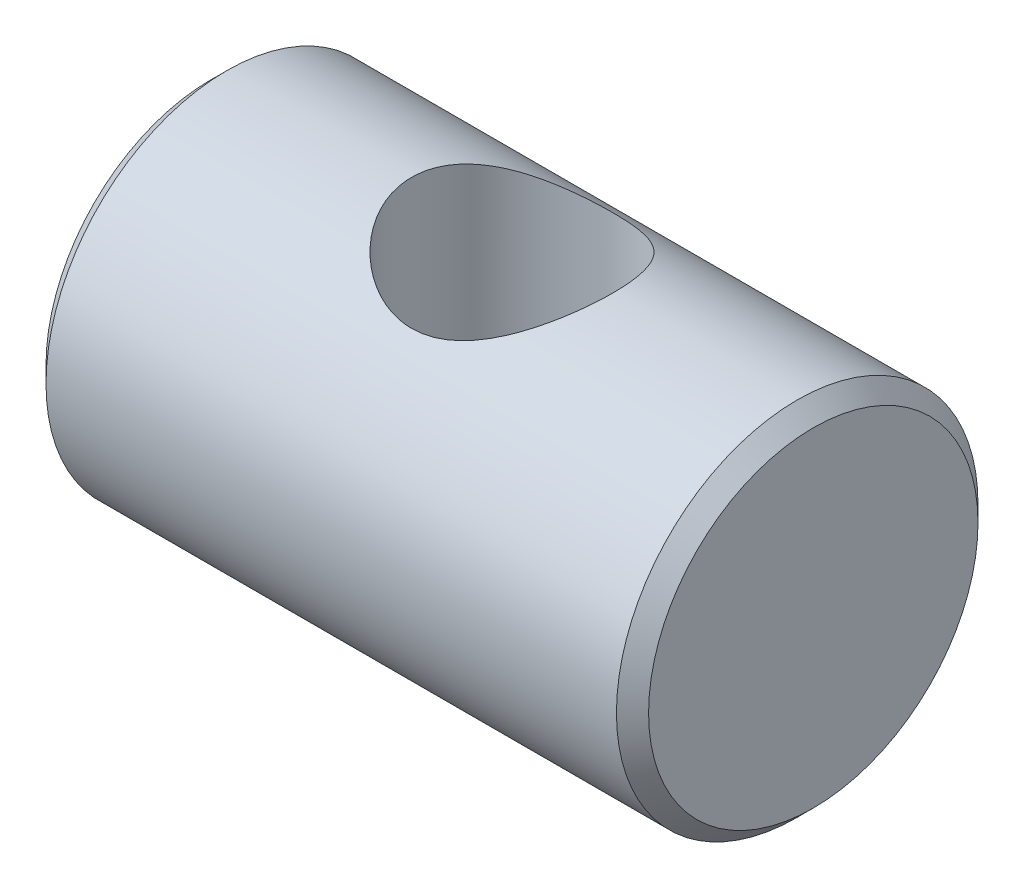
ISO-10303-21;
HEADER;
FILE_DESCRIPTION(('STEP AP214'),'2;1');
FILE_NAME('part.step','',(''),(''),'','','');
FILE_SCHEMA(('AUTOMOTIVE_DESIGN { 1 0 10303 214 1 1 1 1 }'));
ENDSEC;
DATA;
#1=APPLICATION_CONTEXT('core data for automotive mechanical design processes');
#2=APPLICATION_PROTOCOL_DEFINITION('international standard','automotive_design',2000,#1);
#3=PRODUCT_CONTEXT('',#1,'mechanical');
#4=PRODUCT('Part','Part','',(#3));
#5=PRODUCT_RELATED_PRODUCT_CATEGORY('part','',(#4));
#6=PRODUCT_DEFINITION_FORMATION('','',#4);
#7=PRODUCT_DEFINITION_CONTEXT('part definition',#1,'design');
#8=PRODUCT_DEFINITION('design','',#6,#7);
#9=PRODUCT_DEFINITION_SHAPE('','',#8);
#10=(LENGTH_UNIT() NAMED_UNIT(*) SI_UNIT(.MILLI.,.METRE.));
#11=(NAMED_UNIT(*) PLANE_ANGLE_UNIT() SI_UNIT($,.RADIAN.));
#12=(NAMED_UNIT(*) SI_UNIT($,.STERADIAN.) SOLID_ANGLE_UNIT());
#13=UNCERTAINTY_MEASURE_WITH_UNIT(LENGTH_MEASURE(1.E-05),#10,'distance_accuracy_value','');
#14=(GEOMETRIC_REPRESENTATION_CONTEXT(3) GLOBAL_UNCERTAINTY_ASSIGNED_CONTEXT((#13)) GLOBAL_UNIT_ASSIGNED_CONTEXT((#10,
#11,#12)) REPRESENTATION_CONTEXT('',''));
#15=CARTESIAN_POINT('',(0.,0.,0.));
#16=DIRECTION('',(0.,0.,1.));
#17=DIRECTION('',(1.,0.,0.));
#18=AXIS2_PLACEMENT_3D('',#15,#16,#17);
#19=CARTESIAN_POINT('',(7.5,4.1,0.));
#20=DIRECTION('',(-1.,0.,0.));
#21=DIRECTION('',(0.,0.,1.));
#22=AXIS2_PLACEMENT_3D('',#19,#20,#21);
#23=PLANE('',#22);
#24=CARTESIAN_POINT('',(7.49999999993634,0.,0.));
#25=DIRECTION('',(-1.,0.,0.));
#26=DIRECTION('',(0.,0.,1.));
#27=AXIS2_PLACEMENT_3D('',#24,#25,#26);
#28=CIRCLE('',#27,4.099999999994);
#29=CARTESIAN_POINT('',(7.49999999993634,0.,4.099999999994));
#30=VERTEX_POINT('',#29);
#31=EDGE_CURVE('E64',#30,#30,#28,.T.);
#32=ORIENTED_EDGE('',*,*,#31,.F.);
#33=EDGE_LOOP('',(#32));
#34=FACE_BOUND('',#33,.T.);
#35=ADVANCED_FACE('F12',(#34),#23,.F.);
#36=CARTESIAN_POINT('',(-7.5,0.,0.));
#37=DIRECTION('',(1.,0.,0.));
#38=DIRECTION('',(0.,0.,-1.));
#39=AXIS2_PLACEMENT_3D('',#36,#37,#38);
#40=PLANE('',#39);
#41=CARTESIAN_POINT('',(-7.49999999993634,0.,0.));
#42=DIRECTION('',(1.,0.,0.));
#43=DIRECTION('',(0.,0.,-1.));
#44=AXIS2_PLACEMENT_3D('',#41,#42,#43);
#45=CIRCLE('',#44,4.099999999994);
#46=CARTESIAN_POINT('',(-7.49999999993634,0.,-4.099999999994));
#47=VERTEX_POINT('',#46);
#48=EDGE_CURVE('E66',#47,#47,#45,.T.);
#49=ORIENTED_EDGE('',*,*,#48,.F.);
#50=EDGE_LOOP('',(#49));
#51=FACE_BOUND('',#50,.T.);
#52=ADVANCED_FACE('F54',(#51),#40,.F.);
#53=CARTESIAN_POINT('',(7.0999999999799,0.,0.));
#54=DIRECTION('',(-1.,0.,0.));
#55=DIRECTION('',(0.,0.,1.));
#56=AXIS2_PLACEMENT_3D('',#53,#54,#55);
#57=CONICAL_SURFACE('',#56,4.50000000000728,0.785398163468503);
#58=CARTESIAN_POINT('',(7.1,0.,0.));
#59=DIRECTION('',(1.,0.,0.));
#60=DIRECTION('',(0.,0.,-1.));
#61=AXIS2_PLACEMENT_3D('',#58,#59,#60);
#62=CIRCLE('',#61,4.5);
#63=CARTESIAN_POINT('',(7.1,0.,-4.5));
#64=VERTEX_POINT('',#63);
#65=EDGE_CURVE('E31',#64,#64,#62,.F.);
#66=ORIENTED_EDGE('',*,*,#65,.F.);
#67=EDGE_LOOP('',(#66));
#68=FACE_BOUND('',#67,.T.);
#69=ORIENTED_EDGE('',*,*,#31,.T.);
#70=EDGE_LOOP('',(#69));
#71=FACE_BOUND('',#70,.T.);
#72=ADVANCED_FACE('F60',(#68,#71),#57,.T.);
#73=CARTESIAN_POINT('',(-7.09999999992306,0.,0.));
#74=DIRECTION('',(1.,0.,0.));
#75=DIRECTION('',(0.,0.,-1.));
#76=AXIS2_PLACEMENT_3D('',#73,#74,#75);
#77=CONICAL_SURFACE('',#76,4.50000000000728,0.785398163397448);
#78=ORIENTED_EDGE('',*,*,#48,.T.);
#79=EDGE_LOOP('',(#78));
#80=FACE_BOUND('',#79,.T.);
#81=CARTESIAN_POINT('',(-7.1,0.,0.));
#82=DIRECTION('',(1.,0.,0.));
#83=DIRECTION('',(0.,0.,-1.));
#84=AXIS2_PLACEMENT_3D('',#81,#82,#83);
#85=CIRCLE('',#84,4.5);
#86=CARTESIAN_POINT('',(-7.1,0.,-4.5));
#87=VERTEX_POINT('',#86);
#88=EDGE_CURVE('E27',#87,#87,#85,.T.);
#89=ORIENTED_EDGE('',*,*,#88,.F.);
#90=EDGE_LOOP('',(#89));
#91=FACE_BOUND('',#90,.T.);
#92=ADVANCED_FACE('F51',(#80,#91),#77,.T.);
#93=CARTESIAN_POINT('',(7.5,0.,0.));
#94=DIRECTION('',(1.,0.,0.));
#95=DIRECTION('',(0.,0.,-1.));
#96=AXIS2_PLACEMENT_3D('',#93,#94,#95);
#97=CYLINDRICAL_SURFACE('',#96,4.5);
#98=CARTESIAN_POINT('',(2.5,-4.5,0.));
#99=CARTESIAN_POINT('',(2.5000036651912,-4.50000314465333,0.12975809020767));
#100=CARTESIAN_POINT('',(2.48985342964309,-4.49433969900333,0.259495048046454));
#101=CARTESIAN_POINT('',(2.44980813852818,-4.4722793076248,0.514936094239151));
#102=CARTESIAN_POINT('',(2.41990941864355,-4.45588036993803,0.640639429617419));
#103=CARTESIAN_POINT('',(2.34193984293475,-4.41402427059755,0.884087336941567));
#104=CARTESIAN_POINT('',(2.29393574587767,-4.3886004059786,1.0018592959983));
#105=CARTESIAN_POINT('',(2.18156833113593,-4.33092577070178,1.2274597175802));
#106=CARTESIAN_POINT('',(2.11720108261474,-4.29867335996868,1.33528578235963));
#107=CARTESIAN_POINT('',(1.96891331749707,-4.22753981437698,1.54633615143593));
#108=CARTESIAN_POINT('',(1.88394435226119,-4.18835368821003,1.64871905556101));
#109=CARTESIAN_POINT('',(1.69916733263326,-4.10855473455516,1.83858802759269));
#110=CARTESIAN_POINT('',(1.59934431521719,-4.06794050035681,1.92605888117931));
#111=CARTESIAN_POINT('',(1.37568478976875,-3.98505246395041,2.09257063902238));
#112=CARTESIAN_POINT('',(1.25043989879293,-3.94302761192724,2.1698588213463));
#113=CARTESIAN_POINT('',(0.986308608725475,-3.86741690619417,2.30193682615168));
#114=CARTESIAN_POINT('',(0.847442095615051,-3.83381899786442,2.35675885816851));
#115=CARTESIAN_POINT('',(0.589942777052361,-3.78623301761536,2.43228219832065));
#116=CARTESIAN_POINT('',(0.473190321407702,-3.76960776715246,2.4577327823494));
#117=CARTESIAN_POINT('',(0.236264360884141,-3.74726165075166,2.49167870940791));
#118=CARTESIAN_POINT('',(0.116094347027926,-3.74153003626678,2.50019076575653));
#119=CARTESIAN_POINT('',(-0.12433109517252,-3.74178926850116,2.49980245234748));
#120=CARTESIAN_POINT('',(-0.244586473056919,-3.74779295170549,2.49088301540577));
#121=CARTESIAN_POINT('',(-0.481577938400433,-3.77067196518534,2.45610447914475));
#122=CARTESIAN_POINT('',(-0.598311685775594,-3.78755436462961,2.43023436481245));
#123=CARTESIAN_POINT('',(-0.825432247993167,-3.82999424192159,2.36277650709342));
#124=CARTESIAN_POINT('',(-0.93581764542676,-3.85555364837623,2.32118526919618));
#125=CARTESIAN_POINT('',(-1.14840752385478,-3.91258606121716,2.22370256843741));
#126=CARTESIAN_POINT('',(-1.25060878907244,-3.9440613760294,2.16780552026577));
#127=CARTESIAN_POINT('',(-1.46041329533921,-4.01517496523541,2.03346434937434));
#128=CARTESIAN_POINT('',(-1.56647725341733,-4.05532685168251,1.95288470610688));
#129=CARTESIAN_POINT('',(-1.76453695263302,-4.13586693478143,1.77596825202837));
#130=CARTESIAN_POINT('',(-1.85652147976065,-4.17625529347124,1.67961900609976));
#131=CARTESIAN_POINT('',(-2.0331489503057,-4.25757409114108,1.4621390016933));
#132=CARTESIAN_POINT('',(-2.11610219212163,-4.29814437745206,1.33948616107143));
#133=CARTESIAN_POINT('',(-2.25981054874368,-4.37068555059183,1.07947802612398));
#134=CARTESIAN_POINT('',(-2.32058027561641,-4.40266209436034,0.942132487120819));
#135=CARTESIAN_POINT('',(-2.41351083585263,-4.45237093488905,0.666748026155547));
#136=CARTESIAN_POINT('',(-2.44739476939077,-4.4709525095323,0.529448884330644));
#137=CARTESIAN_POINT('',(-2.49147370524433,-4.49522961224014,0.250024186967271));
#138=CARTESIAN_POINT('',(-2.5016896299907,-4.50093652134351,0.107903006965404));
#139=CARTESIAN_POINT('',(-2.4980667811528,-4.49892791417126,-0.159736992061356));
#140=CARTESIAN_POINT('',(-2.48682325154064,-4.49266045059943,-0.285311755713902));
#141=CARTESIAN_POINT('',(-2.44584814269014,-4.4701096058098,-0.532461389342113));
#142=CARTESIAN_POINT('',(-2.41611596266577,-4.45382589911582,-0.654036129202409));
#143=CARTESIAN_POINT('',(-2.33962868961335,-4.41280294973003,-0.889626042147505));
#144=CARTESIAN_POINT('',(-2.29293635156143,-4.38809489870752,-1.00366727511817));
#145=CARTESIAN_POINT('',(-2.18417381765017,-4.33225575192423,-1.22242448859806));
#146=CARTESIAN_POINT('',(-2.12209950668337,-4.30112293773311,-1.32713796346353));
#147=CARTESIAN_POINT('',(-1.97708780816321,-4.23136184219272,-1.53587082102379));
#148=CARTESIAN_POINT('',(-1.89265924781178,-4.19229170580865,-1.63870553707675));
#149=CARTESIAN_POINT('',(-1.70890692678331,-4.1126031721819,-1.82953913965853));
#150=CARTESIAN_POINT('',(-1.6095667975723,-4.07198311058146,-1.91752149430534));
#151=CARTESIAN_POINT('',(-1.38693835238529,-3.98896862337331,-2.08511961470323));
#152=CARTESIAN_POINT('',(-1.26224573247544,-3.94680755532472,-2.16300015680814));
#153=CARTESIAN_POINT('',(-0.999155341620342,-3.87073262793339,-2.29637932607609));
#154=CARTESIAN_POINT('',(-0.860777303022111,-3.83680713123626,-2.3519096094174));
#155=CARTESIAN_POINT('',(-0.603783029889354,-3.78841904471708,-2.42888889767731));
#156=CARTESIAN_POINT('',(-0.487058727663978,-3.77137372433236,-2.45502886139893));
#157=CARTESIAN_POINT('',(-0.250053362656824,-3.74815645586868,-2.49033925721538));
#158=CARTESIAN_POINT('',(-0.129775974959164,-3.74197364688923,-2.49952663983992));
#159=CARTESIAN_POINT('',(0.111021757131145,-3.74136462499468,-2.50043819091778));
#160=CARTESIAN_POINT('',(0.231542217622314,-3.74695304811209,-2.49214061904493));
#161=CARTESIAN_POINT('',(0.469167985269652,-3.76909609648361,-2.45851643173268));
#162=CARTESIAN_POINT('',(0.586271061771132,-3.78565772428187,-2.43317894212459));
#163=CARTESIAN_POINT('',(0.813818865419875,-3.82750534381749,-2.36679483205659));
#164=CARTESIAN_POINT('',(0.924282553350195,-3.85276495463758,-2.32579567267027));
#165=CARTESIAN_POINT('',(1.13710828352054,-3.90927937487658,-2.2294944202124));
#166=CARTESIAN_POINT('',(1.23946718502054,-3.94053649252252,-2.17418681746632));
#167=CARTESIAN_POINT('',(1.44956229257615,-4.01123588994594,-2.04119262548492));
#168=CARTESIAN_POINT('',(1.55578441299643,-4.05120181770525,-1.96138962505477));
#169=CARTESIAN_POINT('',(1.75429511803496,-4.13150106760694,-1.7860593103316));
#170=CARTESIAN_POINT('',(1.84657233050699,-4.17183466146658,-1.6905192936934));
#171=CARTESIAN_POINT('',(2.02421264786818,-4.25330121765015,-1.47447866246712));
#172=CARTESIAN_POINT('',(2.10785564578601,-4.29408020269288,-1.35241492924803));
#173=CARTESIAN_POINT('',(2.25305506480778,-4.36718657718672,-1.09349141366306));
#174=CARTESIAN_POINT('',(2.31462759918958,-4.3995201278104,-0.956642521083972));
#175=CARTESIAN_POINT('',(2.40827143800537,-4.44953408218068,-0.684823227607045));
#176=CARTESIAN_POINT('',(2.44250264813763,-4.46827306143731,-0.550796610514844));
#177=CARTESIAN_POINT('',(2.48835611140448,-4.49349953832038,-0.277835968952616));
#178=CARTESIAN_POINT('',(2.49999607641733,-4.49999663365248,-0.138905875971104));
#179=CARTESIAN_POINT('',(2.5,-4.5,0.));
#180=B_SPLINE_CURVE_WITH_KNOTS('',3,(#98,#99,#100,#101,#102,#103,#104,#105,#106,#107,#108,#109,
#110,#111,#112,#113,#114,#115,#116,#117,#118,#119,#120,#121,#122,#123,#124,#125,#126,#127,#128,
#129,#130,#131,#132,#133,#134,#135,#136,#137,#138,#139,#140,#141,#142,#143,#144,#145,#146,#147,
#148,#149,#150,#151,#152,#153,#154,#155,#156,#157,#158,#159,#160,#161,#162,#163,#164,#165,#166,
#167,#168,#169,#170,#171,#172,#173,#174,#175,#176,#177,#178,#179),.UNSPECIFIED.,.T.,.F.,(4,2,2,
2,2,2,2,2,2,2,2,2,2,2,2,2,2,2,2,2,2,2,2,2,2,2,2,2,2,2,2,2,2,2,2,2,2,2,2,2,4),(0.,
0.388735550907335,0.777543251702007,1.16493112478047,1.55241214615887,1.96683794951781,
2.38168408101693,2.83857267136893,3.29480391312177,3.6551617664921,4.01516387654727,
4.37555999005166,4.73619053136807,5.09690128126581,5.45775307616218,5.87344204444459,
6.2894603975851,6.74765475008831,7.20554674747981,7.63096944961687,8.05601593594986,
8.43288535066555,8.80976701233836,9.18526813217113,9.56086981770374,9.97519675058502,
10.389981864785,10.846544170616,11.3024575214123,11.6633530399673,12.0238875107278,
12.3848705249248,12.7460841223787,13.1062116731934,13.466478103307,13.8810342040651,
14.2959265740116,14.7540149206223,15.2117681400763,15.6282357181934,16.0443766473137),.UNSPECIFIED.);
#181=CARTESIAN_POINT('',(2.5,-4.5,0.));
#182=VERTEX_POINT('',#181);
#183=EDGE_CURVE('E8',#182,#182,#180,.T.);
#184=ORIENTED_EDGE('',*,*,#183,.F.);
#185=EDGE_LOOP('',(#184));
#186=FACE_BOUND('',#185,.T.);
#187=CARTESIAN_POINT('',(0.,3.74165738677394,2.5));
#188=CARTESIAN_POINT('',(0.127867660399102,3.7416726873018,2.4999886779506));
#189=CARTESIAN_POINT('',(0.255847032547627,3.74831704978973,2.49012046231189));
#190=CARTESIAN_POINT('',(0.507679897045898,3.77384839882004,2.45123834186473));
#191=CARTESIAN_POINT('',(0.631526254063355,3.79275551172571,2.42219296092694));
#192=CARTESIAN_POINT('',(0.870945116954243,3.83989933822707,2.34672518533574));
#193=CARTESIAN_POINT('',(0.986564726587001,3.86807667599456,2.30041313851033));
#194=CARTESIAN_POINT('',(1.20834600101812,3.93048941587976,2.19206578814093));
#195=CARTESIAN_POINT('',(1.31450555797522,3.96472616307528,2.13002699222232));
#196=CARTESIAN_POINT('',(1.52641671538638,4.03969403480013,1.98449846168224));
#197=CARTESIAN_POINT('',(1.63099357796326,4.08073069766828,1.89945493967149));
#198=CARTESIAN_POINT('',(1.82534633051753,4.16222299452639,1.71353751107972));
#199=CARTESIAN_POINT('',(1.91511315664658,4.20267825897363,1.61265398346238));
#200=CARTESIAN_POINT('',(2.08508983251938,4.28269640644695,1.3870985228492));
#201=CARTESIAN_POINT('',(2.1637603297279,4.32186646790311,1.26111369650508));
#202=CARTESIAN_POINT('',(2.29824166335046,4.39073714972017,0.995108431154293));
#203=CARTESIAN_POINT('',(2.35407027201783,4.4204451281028,0.85509901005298));
#204=CARTESIAN_POINT('',(2.43630568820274,4.46480622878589,0.577542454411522));
#205=CARTESIAN_POINT('',(2.46480060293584,4.48051966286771,0.440787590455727));
#206=CARTESIAN_POINT('',(2.49853448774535,4.49916269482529,0.163616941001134));
#207=CARTESIAN_POINT('',(2.50379152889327,4.50210222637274,0.0232040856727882));
#208=CARTESIAN_POINT('',(2.4914765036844,4.4952695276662,-0.241178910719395));
#209=CARTESIAN_POINT('',(2.47628215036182,4.48682112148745,-0.365303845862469));
#210=CARTESIAN_POINT('',(2.42789099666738,4.46029652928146,-0.608906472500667));
#211=CARTESIAN_POINT('',(2.39469280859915,4.44221960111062,-0.72838380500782));
#212=CARTESIAN_POINT('',(2.31126649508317,4.39780601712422,-0.96097965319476));
#213=CARTESIAN_POINT('',(2.26086630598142,4.37138611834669,-1.07401990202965));
#214=CARTESIAN_POINT('',(2.14483738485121,4.31251997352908,-1.29025059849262));
#215=CARTESIAN_POINT('',(2.07920386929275,4.28007183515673,-1.39343793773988));
#216=CARTESIAN_POINT('',(1.92640653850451,4.20785286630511,-1.59909620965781));
#217=CARTESIAN_POINT('',(1.83767397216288,4.16766932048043,-1.70025747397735));
#218=CARTESIAN_POINT('',(1.64533173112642,4.08650106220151,-1.88703556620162));
#219=CARTESIAN_POINT('',(1.54170632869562,4.04551554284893,-1.97263574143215));
#220=CARTESIAN_POINT('',(1.31107929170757,3.96312397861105,-2.13367090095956));
#221=CARTESIAN_POINT('',(1.1828097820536,3.92201714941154,-2.2074790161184));
#222=CARTESIAN_POINT('',(0.980669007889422,3.86749177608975,-2.30082855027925));
#223=CARTESIAN_POINT('',(0.911652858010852,3.8505034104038,-2.32905476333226));
#224=CARTESIAN_POINT('',(0.770776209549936,3.81960529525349,-2.3793879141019));
#225=CARTESIAN_POINT('',(0.698917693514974,3.80569344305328,-2.4014990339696));
#226=CARTESIAN_POINT('',(0.558744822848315,3.7825660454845,-2.43774893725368));
#227=CARTESIAN_POINT('',(0.49060568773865,3.77306418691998,-2.45238335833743));
#228=CARTESIAN_POINT('',(0.352979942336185,3.75764870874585,-2.47593920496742));
#229=CARTESIAN_POINT('',(0.283494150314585,3.75173297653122,-2.48486399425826));
#230=CARTESIAN_POINT('',(0.143844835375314,3.7437735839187,-2.49684067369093));
#231=CARTESIAN_POINT('',(0.0736818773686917,3.74172693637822,-2.49989709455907));
#232=CARTESIAN_POINT('',(-0.0666321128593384,3.74159115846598,-2.5000979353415));
#233=CARTESIAN_POINT('',(-0.136783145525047,3.74350157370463,-2.49724303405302));
#234=CARTESIAN_POINT('',(-0.32521266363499,3.75390669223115,-2.48160454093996));
#235=CARTESIAN_POINT('',(-0.442885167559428,3.7660681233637,-2.46327912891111));
#236=CARTESIAN_POINT('',(-0.673061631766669,3.79999671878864,-2.41059641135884));
#237=CARTESIAN_POINT('',(-0.785563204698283,3.8217682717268,-2.37623178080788));
#238=CARTESIAN_POINT('',(-1.00774180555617,3.8734200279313,-2.29111009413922));
#239=CARTESIAN_POINT('',(-1.11711092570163,3.90359765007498,-2.23973536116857));
#240=CARTESIAN_POINT('',(-1.32632576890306,3.96852930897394,-2.12255957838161));
#241=CARTESIAN_POINT('',(-1.42616680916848,4.00328557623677,-2.05675148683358));
#242=CARTESIAN_POINT('',(-1.63049062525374,4.08021308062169,-1.90016864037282));
#243=CARTESIAN_POINT('',(-1.73309682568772,4.12267224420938,-1.80707526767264));
#244=CARTESIAN_POINT('',(-1.92199935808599,4.20557655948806,-1.60470900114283));
#245=CARTESIAN_POINT('',(-2.00828561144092,4.24602045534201,-1.49542618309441));
#246=CARTESIAN_POINT('',(-2.16643294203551,4.32300875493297,-1.25626042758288));
#247=CARTESIAN_POINT('',(-2.23726807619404,4.3592262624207,-1.12558547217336));
#248=CARTESIAN_POINT('',(-2.35519631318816,4.42090637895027,-0.851602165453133));
#249=CARTESIAN_POINT('',(-2.40231447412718,4.44638033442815,-0.708307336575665));
#250=CARTESIAN_POINT('',(-2.46664777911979,4.48148519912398,-0.428990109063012));
#251=CARTESIAN_POINT('',(-2.48643742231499,4.49247473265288,-0.29373267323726));
#252=CARTESIAN_POINT('',(-2.50362240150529,4.5020067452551,-0.0213910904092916));
#253=CARTESIAN_POINT('',(-2.50103007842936,4.50055608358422,0.115692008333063));
#254=CARTESIAN_POINT('',(-2.47491437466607,4.4861017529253,0.374337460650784));
#255=CARTESIAN_POINT('',(-2.45334235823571,4.47417531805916,0.496165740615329));
#256=CARTESIAN_POINT('',(-2.39292228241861,4.44133257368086,0.734167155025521));
#257=CARTESIAN_POINT('',(-2.3540722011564,4.42041521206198,0.850339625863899));
#258=CARTESIAN_POINT('',(-2.25905612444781,4.3705432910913,1.07814775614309));
#259=CARTESIAN_POINT('',(-2.202363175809,4.34134725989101,1.18950897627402));
#260=CARTESIAN_POINT('',(-2.07393542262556,4.27762772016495,1.40148896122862));
#261=CARTESIAN_POINT('',(-2.00219469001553,4.24310211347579,1.50210346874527));
#262=CARTESIAN_POINT('',(-1.83613517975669,4.16717195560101,1.70217916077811));
#263=CARTESIAN_POINT('',(-1.74016022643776,4.12543450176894,1.8001424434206));
#264=CARTESIAN_POINT('',(-1.53330418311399,4.04252541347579,1.97933250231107));
#265=CARTESIAN_POINT('',(-1.42240466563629,4.0013545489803,2.06053826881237));
#266=CARTESIAN_POINT('',(-1.17899936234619,3.92122408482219,2.20944802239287));
#267=CARTESIAN_POINT('',(-1.04552040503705,3.88262653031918,2.27579178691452));
#268=CARTESIAN_POINT('',(-0.83652666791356,3.83343009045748,2.35707752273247));
#269=CARTESIAN_POINT('',(-0.765460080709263,3.81848976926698,2.38112244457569));
#270=CARTESIAN_POINT('',(-0.620861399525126,3.79215325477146,2.4228459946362));
#271=CARTESIAN_POINT('',(-0.547330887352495,3.78075483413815,2.44052862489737));
#272=CARTESIAN_POINT('',(-0.395409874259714,3.7617084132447,2.4697920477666));
#273=CARTESIAN_POINT('',(-0.316943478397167,3.75423236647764,2.48109451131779));
#274=CARTESIAN_POINT('',(-0.158999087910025,3.74420222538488,2.49620181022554));
#275=CARTESIAN_POINT('',(-0.0795211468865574,3.74164787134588,2.50000704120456));
#276=CARTESIAN_POINT('',(0.,3.74165738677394,2.5));
#277=B_SPLINE_CURVE_WITH_KNOTS('',3,(#187,#188,#189,#190,#191,#192,#193,#194,#195,#196,#197,
#198,#199,#200,#201,#202,#203,#204,#205,#206,#207,#208,#209,#210,#211,#212,#213,#214,#215,#216,
#217,#218,#219,#220,#221,#222,#223,#224,#225,#226,#227,#228,#229,#230,#231,#232,#233,#234,#235,
#236,#237,#238,#239,#240,#241,#242,#243,#244,#245,#246,#247,#248,#249,#250,#251,#252,#253,#254,
#255,#256,#257,#258,#259,#260,#261,#262,#263,#264,#265,#266,#267,#268,#269,#270,#271,#272,#273,
#274,#275,#276),.UNSPECIFIED.,.T.,.F.,(4,2,2,2,2,2,2,2,2,2,2,2,2,2,2,2,2,2,2,2,2,2,2,2,2,2,2,2,
2,2,2,2,2,2,2,2,2,2,2,2,2,2,2,2,4),(0.,0.383275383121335,0.767181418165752,1.14867490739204,
1.53025318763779,1.95124472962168,2.37249297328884,2.8308639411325,3.2888775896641,
3.70817544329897,4.12714717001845,4.50138183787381,4.8756453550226,5.25376784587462,
5.63200923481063,6.05157027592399,6.47157769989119,6.92969119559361,7.15882945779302,
7.38781062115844,7.59850621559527,7.80907756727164,8.01948627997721,8.22987083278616,
8.58719279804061,8.94467811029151,9.31690871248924,9.68932132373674,10.122176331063,
10.5552977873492,11.0117233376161,11.4676656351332,11.8767730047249,12.2856548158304,
12.6568475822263,13.0280837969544,13.4115163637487,13.7951002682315,14.2233400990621,
14.6521136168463,15.1111969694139,15.3403711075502,15.5694008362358,15.80777312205,
16.0461328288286),.UNSPECIFIED.);
#278=CARTESIAN_POINT('',(0.,3.74165738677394,2.5));
#279=VERTEX_POINT('',#278);
#280=EDGE_CURVE('E23',#279,#279,#277,.T.);
#281=ORIENTED_EDGE('',*,*,#280,.F.);
#282=EDGE_LOOP('',(#281));
#283=FACE_BOUND('',#282,.T.);
#284=ORIENTED_EDGE('',*,*,#88,.T.);
#285=EDGE_LOOP('',(#284));
#286=FACE_BOUND('',#285,.T.);
#287=ORIENTED_EDGE('',*,*,#65,.T.);
#288=EDGE_LOOP('',(#287));
#289=FACE_BOUND('',#288,.T.);
#290=ADVANCED_FACE('F39',(#186,#283,#286,#289),#97,.T.);
#291=CARTESIAN_POINT('',(0.,-4.5,0.));
#292=DIRECTION('',(0.,1.,0.));
#293=DIRECTION('',(0.,0.,1.));
#294=AXIS2_PLACEMENT_3D('',#291,#292,#293);
#295=CYLINDRICAL_SURFACE('',#294,2.5);
#296=ORIENTED_EDGE('',*,*,#183,.T.);
#297=EDGE_LOOP('',(#296));
#298=FACE_BOUND('',#297,.T.);
#299=ORIENTED_EDGE('',*,*,#280,.T.);
#300=EDGE_LOOP('',(#299));
#301=FACE_BOUND('',#300,.T.);
#302=ADVANCED_FACE('F42',(#298,#301),#295,.F.);
#303=CLOSED_SHELL('',(#35,#52,#72,#92,#290,#302));
#304=MANIFOLD_SOLID_BREP('B1',#303);
#305=ADVANCED_BREP_SHAPE_REPRESENTATION('',(#18,#304),#14);
#306=SHAPE_DEFINITION_REPRESENTATION(#9,#305);
ENDSEC;
END-ISO-10303-21;
